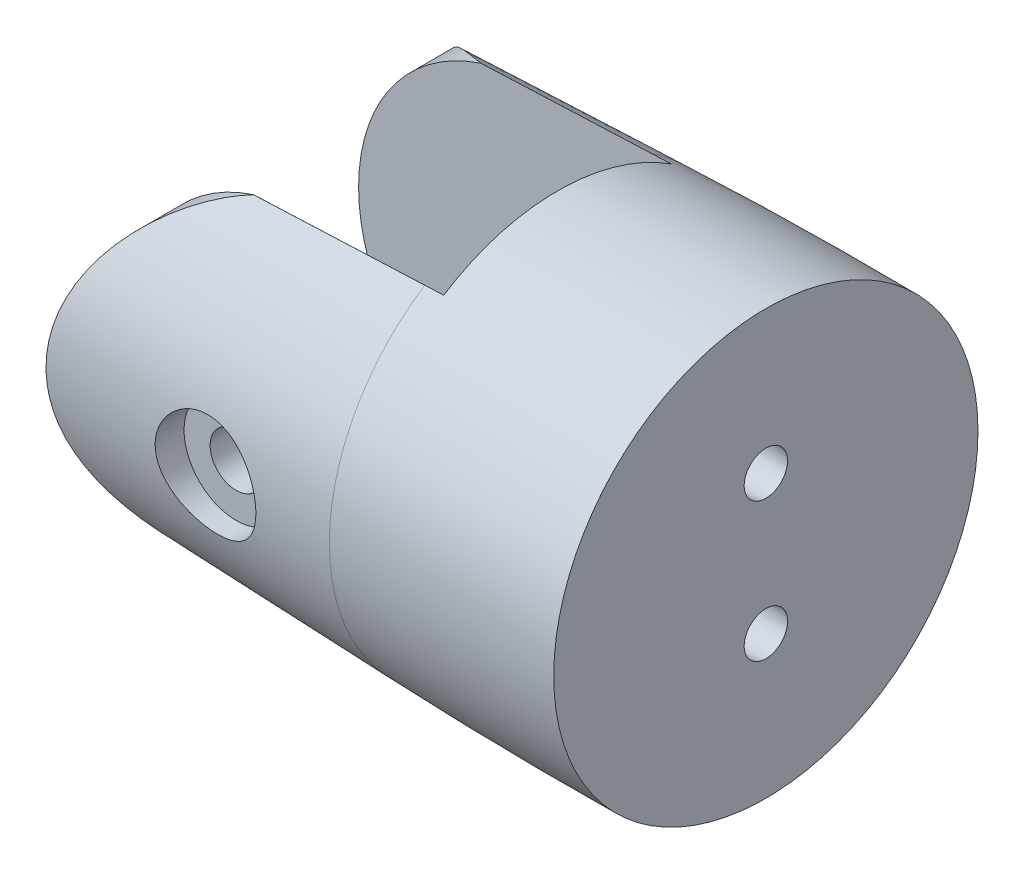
ISO-10303-21;
HEADER;
FILE_DESCRIPTION(('STEP AP214'),'2;1');
FILE_NAME('part.step','',(''),(''),'','','');
FILE_SCHEMA(('AUTOMOTIVE_DESIGN { 1 0 10303 214 1 1 1 1 }'));
ENDSEC;
DATA;
#1=APPLICATION_CONTEXT('core data for automotive mechanical design processes');
#2=APPLICATION_PROTOCOL_DEFINITION('international standard','automotive_design',2000,#1);
#3=PRODUCT_CONTEXT('',#1,'mechanical');
#4=PRODUCT('Part','Part','',(#3));
#5=PRODUCT_RELATED_PRODUCT_CATEGORY('part','',(#4));
#6=PRODUCT_DEFINITION_FORMATION('','',#4);
#7=PRODUCT_DEFINITION_CONTEXT('part definition',#1,'design');
#8=PRODUCT_DEFINITION('design','',#6,#7);
#9=PRODUCT_DEFINITION_SHAPE('','',#8);
#10=(LENGTH_UNIT() NAMED_UNIT(*) SI_UNIT(.MILLI.,.METRE.));
#11=(NAMED_UNIT(*) PLANE_ANGLE_UNIT() SI_UNIT($,.RADIAN.));
#12=(NAMED_UNIT(*) SI_UNIT($,.STERADIAN.) SOLID_ANGLE_UNIT());
#13=UNCERTAINTY_MEASURE_WITH_UNIT(LENGTH_MEASURE(1.E-05),#10,'distance_accuracy_value','');
#14=(GEOMETRIC_REPRESENTATION_CONTEXT(3) GLOBAL_UNCERTAINTY_ASSIGNED_CONTEXT((#13)) GLOBAL_UNIT_ASSIGNED_CONTEXT((#10,
#11,#12)) REPRESENTATION_CONTEXT('',''));
#15=CARTESIAN_POINT('',(0.,0.,0.));
#16=DIRECTION('',(0.,0.,1.));
#17=DIRECTION('',(1.,0.,0.));
#18=AXIS2_PLACEMENT_3D('',#15,#16,#17);
#19=CARTESIAN_POINT('',(0.,0.,0.));
#20=DIRECTION('',(1.,0.,0.));
#21=DIRECTION('',(0.,0.,-1.));
#22=AXIS2_PLACEMENT_3D('',#19,#20,#21);
#23=CONICAL_SURFACE('',#22,12.5,0.0349065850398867);
#24=CARTESIAN_POINT('',(-20.9999999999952,-9.77279188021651,0.));
#25=DIRECTION('',(0.0420082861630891,0.999117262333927,0.));
#26=DIRECTION('',(0.999117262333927,-0.0420082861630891,0.));
#27=AXIS2_PLACEMENT_3D('',#24,#25,#26);
#28=ELLIPSE('',#27,280.103401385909,6.55338971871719);
#29=CARTESIAN_POINT('',(-13.0903037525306,-10.1053582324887,6.55077170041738));
#30=VERTEX_POINT('',#29);
#31=CARTESIAN_POINT('',(-22.9498771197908,-9.69080851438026,6.55323064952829));
#32=VERTEX_POINT('',#31);
#33=EDGE_CURVE('E210',#30,#32,#28,.F.);
#34=ORIENTED_EDGE('',*,*,#33,.F.);
#35=CARTESIAN_POINT('',(-13.0903037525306,0.,0.));
#36=DIRECTION('',(1.,0.,0.));
#37=DIRECTION('',(0.,0.,-1.));
#38=AXIS2_PLACEMENT_3D('',#35,#36,#37);
#39=CIRCLE('',#38,12.0428765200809);
#40=CARTESIAN_POINT('',(-13.0903037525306,10.1053582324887,6.5507717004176));
#41=VERTEX_POINT('',#40);
#42=EDGE_CURVE('E638',#30,#41,#39,.F.);
#43=ORIENTED_EDGE('',*,*,#42,.T.);
#44=CARTESIAN_POINT('',(-21.0000000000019,9.77279188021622,0.));
#45=DIRECTION('',(0.0420082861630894,-0.999117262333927,0.));
#46=DIRECTION('',(0.999117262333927,0.0420082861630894,0.));
#47=AXIS2_PLACEMENT_3D('',#44,#45,#46);
#48=ELLIPSE('',#47,280.103401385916,6.55338971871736);
#49=CARTESIAN_POINT('',(-22.9498771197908,9.69080851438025,6.55323064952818));
#50=VERTEX_POINT('',#49);
#51=EDGE_CURVE('E226',#50,#41,#48,.F.);
#52=ORIENTED_EDGE('',*,*,#51,.F.);
#53=CARTESIAN_POINT('',(-22.9496771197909,-9.69087321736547,6.55314743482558));
#54=CARTESIAN_POINT('',(-23.0999575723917,-9.64224563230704,6.61570730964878));
#55=CARTESIAN_POINT('',(-23.2478404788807,-9.59055452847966,6.68148349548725));
#56=CARTESIAN_POINT('',(-23.5388927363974,-9.48133076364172,6.81818877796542));
#57=CARTESIAN_POINT('',(-23.6820646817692,-9.42380139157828,6.88911496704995));
#58=CARTESIAN_POINT('',(-23.9637096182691,-9.30323209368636,7.03479189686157));
#59=CARTESIAN_POINT('',(-24.1021900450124,-9.24020151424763,7.10953606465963));
#60=CARTESIAN_POINT('',(-24.3748915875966,-9.10870549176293,7.26198183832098));
#61=CARTESIAN_POINT('',(-24.5091120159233,-9.04023917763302,7.33968391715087));
#62=CARTESIAN_POINT('',(-24.9067360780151,-8.82626761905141,7.576586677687));
#63=CARTESIAN_POINT('',(-25.1639513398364,-8.67268558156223,7.73897252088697));
#64=CARTESIAN_POINT('',(-25.6627140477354,-8.34449966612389,8.06673484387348));
#65=CARTESIAN_POINT('',(-25.9042534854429,-8.16988517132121,8.23211279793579));
#66=CARTESIAN_POINT('',(-26.3703049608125,-7.80080677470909,8.56062203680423));
#67=CARTESIAN_POINT('',(-26.5949089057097,-7.60646583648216,8.72376081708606));
#68=CARTESIAN_POINT('',(-27.0280580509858,-7.19700739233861,9.04519751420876));
#69=CARTESIAN_POINT('',(-27.2366050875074,-6.98189226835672,9.2034959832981));
#70=CARTESIAN_POINT('',(-27.6360975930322,-6.53121939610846,9.51167898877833));
#71=CARTESIAN_POINT('',(-27.8270761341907,-6.29570174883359,9.66157911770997));
#72=CARTESIAN_POINT('',(-28.1900952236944,-5.80401574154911,9.95003154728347));
#73=CARTESIAN_POINT('',(-28.3621410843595,-5.54785320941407,10.0885870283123));
#74=CARTESIAN_POINT('',(-28.6444267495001,-5.08239404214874,10.3180459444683));
#75=CARTESIAN_POINT('',(-28.7593317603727,-4.87750264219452,10.4121728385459));
#76=CARTESIAN_POINT('',(-28.9761412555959,-4.45694744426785,10.5907939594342));
#77=CARTESIAN_POINT('',(-29.0780488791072,-4.2412862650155,10.675290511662));
#78=CARTESIAN_POINT('',(-29.2676474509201,-3.79997961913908,10.8332083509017));
#79=CARTESIAN_POINT('',(-29.3553442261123,-3.57433829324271,10.906634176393));
#80=CARTESIAN_POINT('',(-29.5153456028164,-3.11403643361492,11.0410652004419));
#81=CARTESIAN_POINT('',(-29.5876498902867,-2.87937571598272,11.1020701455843));
#82=CARTESIAN_POINT('',(-29.7162027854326,-2.40053071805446,11.2108086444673));
#83=CARTESIAN_POINT('',(-29.772316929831,-2.15628480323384,11.258430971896));
#84=CARTESIAN_POINT('',(-29.8666511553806,-1.66190955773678,11.3386228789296));
#85=CARTESIAN_POINT('',(-29.9048712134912,-1.41178021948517,11.3711924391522));
#86=CARTESIAN_POINT('',(-29.9626180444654,-0.90794314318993,11.4204426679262));
#87=CARTESIAN_POINT('',(-29.9821543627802,-0.654237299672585,11.4371314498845));
#88=CARTESIAN_POINT('',(-30.0021394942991,-0.145540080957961,11.4542038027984));
#89=CARTESIAN_POINT('',(-30.0025904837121,0.109451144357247,11.4545892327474));
#90=CARTESIAN_POINT('',(-29.9855286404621,0.586879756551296,11.4400138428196));
#91=CARTESIAN_POINT('',(-29.9702211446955,0.809459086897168,11.4269370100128));
#92=CARTESIAN_POINT('',(-29.9251968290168,1.25206526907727,11.3885221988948));
#93=CARTESIAN_POINT('',(-29.8954814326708,1.47209237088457,11.3631854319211));
#94=CARTESIAN_POINT('',(-29.8221169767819,1.90809854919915,11.3007487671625));
#95=CARTESIAN_POINT('',(-29.7784680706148,2.12407767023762,11.2636489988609));
#96=CARTESIAN_POINT('',(-29.6778851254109,2.55068328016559,11.1783739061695));
#97=CARTESIAN_POINT('',(-29.620950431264,2.76130950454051,11.1301980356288));
#98=CARTESIAN_POINT('',(-29.4939570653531,3.17809615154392,11.0230873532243));
#99=CARTESIAN_POINT('',(-29.4237771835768,3.38419396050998,10.9640533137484));
#100=CARTESIAN_POINT('',(-29.2714899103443,3.78897416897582,10.8364665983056));
#101=CARTESIAN_POINT('',(-29.1893779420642,3.98765368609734,10.7679102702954));
#102=CARTESIAN_POINT('',(-29.0141072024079,4.37686048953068,10.6222855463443));
#103=CARTESIAN_POINT('',(-28.9209473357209,4.56738696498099,10.5452163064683));
#104=CARTESIAN_POINT('',(-28.7244178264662,4.93981332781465,10.3835765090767));
#105=CARTESIAN_POINT('',(-28.6210460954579,5.1217114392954,10.2990044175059));
#106=CARTESIAN_POINT('',(-28.3547774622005,5.5587779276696,10.0826594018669));
#107=CARTESIAN_POINT('',(-28.1864907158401,5.80884921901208,9.94717125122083));
#108=CARTESIAN_POINT('',(-27.8318385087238,6.28929989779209,9.66535945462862));
#109=CARTESIAN_POINT('',(-27.6454670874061,6.51967274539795,9.51903224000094));
#110=CARTESIAN_POINT('',(-27.255849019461,6.96109265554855,9.2182246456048));
#111=CARTESIAN_POINT('',(-27.0525632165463,7.17209235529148,9.0637256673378));
#112=CARTESIAN_POINT('',(-26.6306079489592,7.57423731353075,8.74995503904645));
#113=CARTESIAN_POINT('',(-26.4119366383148,7.76538018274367,8.59068281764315));
#114=CARTESIAN_POINT('',(-25.9492205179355,8.13636680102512,8.26319972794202));
#115=CARTESIAN_POINT('',(-25.7044674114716,8.31526452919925,8.09491908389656));
#116=CARTESIAN_POINT('',(-25.1987488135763,8.65130250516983,7.76119702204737));
#117=CARTESIAN_POINT('',(-24.9377909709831,8.80845290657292,7.59575431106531));
#118=CARTESIAN_POINT('',(-24.5341882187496,9.02721478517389,7.35434233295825));
#119=CARTESIAN_POINT('',(-24.3979325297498,9.09717565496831,7.27516023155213));
#120=CARTESIAN_POINT('',(-24.1210230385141,9.23148090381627,7.11980775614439));
#121=CARTESIAN_POINT('',(-23.9803699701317,9.29582621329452,7.04363688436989));
#122=CARTESIAN_POINT('',(-23.6942321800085,9.41884065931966,6.89520186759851));
#123=CARTESIAN_POINT('',(-23.5487398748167,9.47750026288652,6.82294437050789));
#124=CARTESIAN_POINT('',(-23.2528861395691,9.58878931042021,6.68373021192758));
#125=CARTESIAN_POINT('',(-23.1025219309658,9.64141523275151,6.61677665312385));
#126=CARTESIAN_POINT('',(-22.9496771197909,9.69087321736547,6.55314743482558));
#127=B_SPLINE_CURVE_WITH_KNOTS('',3,(#53,#54,#55,#56,#57,#58,#59,#60,#61,#62,#63,#64,#65,#66,
#67,#68,#69,#70,#71,#72,#73,#74,#75,#76,#77,#78,#79,#80,#81,#82,#83,#84,#85,#86,#87,#88,#89,#90,
#91,#92,#93,#94,#95,#96,#97,#98,#99,#100,#101,#102,#103,#104,#105,#106,#107,#108,#109,#110,#111,
#112,#113,#114,#115,#116,#117,#118,#119,#120,#121,#122,#123,#124,#125,#126),.UNSPECIFIED.,.F.,
.F.,(4,2,2,2,2,2,2,2,2,2,2,2,2,2,2,2,2,2,2,2,2,2,2,2,2,2,2,2,2,2,2,2,2,2,2,2,4),(0.,
0.509508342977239,1.01873123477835,1.52710521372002,2.03556082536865,3.0566421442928,
4.07824106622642,5.0938231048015,6.1092888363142,7.12280209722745,8.13603024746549,
8.89456564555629,9.65291749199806,10.4109575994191,11.1690131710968,11.9331943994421,
12.6973766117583,13.4611681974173,14.2248726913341,14.8945298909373,15.5641209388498,
16.23370461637,16.9033213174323,17.5793923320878,18.2557233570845,18.9321214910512,
19.6086582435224,20.5986297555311,21.5889286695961,22.5815875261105,23.5743656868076,
24.6135573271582,25.6522621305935,26.169393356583,26.6864387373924,27.204336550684,
27.722535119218),.UNSPECIFIED.);
#128=EDGE_CURVE('E219',#32,#50,#127,.T.);
#129=ORIENTED_EDGE('',*,*,#128,.F.);
#130=EDGE_LOOP('',(#34,#43,#52,#129));
#131=FACE_BOUND('',#130,.T.);
#132=CARTESIAN_POINT('',(-22.5915563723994,-2.75628917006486,11.3821084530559));
#133=CARTESIAN_POINT('',(-22.7130119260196,-2.63816633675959,11.4063472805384));
#134=CARTESIAN_POINT('',(-22.8243953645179,-2.50978719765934,11.4315122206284));
#135=CARTESIAN_POINT('',(-23.0240436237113,-2.23593907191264,11.4811119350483));
#136=CARTESIAN_POINT('',(-23.112293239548,-2.09045893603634,11.5055462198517));
#137=CARTESIAN_POINT('',(-23.2631622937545,-1.78619715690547,11.5513590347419));
#138=CARTESIAN_POINT('',(-23.3257686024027,-1.62740874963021,11.572735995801));
#139=CARTESIAN_POINT('',(-23.4232574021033,-1.30100263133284,11.6105317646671));
#140=CARTESIAN_POINT('',(-23.458148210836,-1.13338758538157,11.6269520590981));
#141=CARTESIAN_POINT('',(-23.4986045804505,-0.796945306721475,11.653390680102));
#142=CARTESIAN_POINT('',(-23.5046393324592,-0.628182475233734,11.6635090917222));
#143=CARTESIAN_POINT('',(-23.4882864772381,-0.291777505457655,11.6773390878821));
#144=CARTESIAN_POINT('',(-23.4659012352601,-0.124135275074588,11.6810512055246));
#145=CARTESIAN_POINT('',(-23.3940567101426,0.201662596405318,11.6824345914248));
#146=CARTESIAN_POINT('',(-23.3451585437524,0.359941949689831,11.6802274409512));
#147=CARTESIAN_POINT('',(-23.2220828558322,0.666194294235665,11.6710735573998));
#148=CARTESIAN_POINT('',(-23.147904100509,0.81416678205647,11.6641265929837));
#149=CARTESIAN_POINT('',(-22.9757273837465,1.09684285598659,11.6470011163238));
#150=CARTESIAN_POINT('',(-22.8775555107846,1.23143898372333,11.6367988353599));
#151=CARTESIAN_POINT('',(-22.6603833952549,1.48251678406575,11.6151311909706));
#152=CARTESIAN_POINT('',(-22.5413808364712,1.59899643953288,11.603665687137));
#153=CARTESIAN_POINT('',(-22.2835790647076,1.81250622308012,11.581367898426));
#154=CARTESIAN_POINT('',(-22.1444825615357,1.90917924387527,11.5705493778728));
#155=CARTESIAN_POINT('',(-21.8518703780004,2.07784364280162,11.5518381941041));
#156=CARTESIAN_POINT('',(-21.6983553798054,2.14983618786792,11.5439453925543));
#157=CARTESIAN_POINT('',(-21.3819097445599,2.26676275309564,11.5328191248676));
#158=CARTESIAN_POINT('',(-21.219021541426,2.31180959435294,11.529566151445));
#159=CARTESIAN_POINT('',(-20.8879922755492,2.37394943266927,11.5287360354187));
#160=CARTESIAN_POINT('',(-20.7198518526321,2.3910458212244,11.5311582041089));
#161=CARTESIAN_POINT('',(-20.3860167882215,2.39678723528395,11.5418723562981));
#162=CARTESIAN_POINT('',(-20.220326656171,2.38588872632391,11.5500686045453));
#163=CARTESIAN_POINT('',(-19.8933384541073,2.33705091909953,11.5716977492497));
#164=CARTESIAN_POINT('',(-19.7320405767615,2.29911043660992,11.5851308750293));
#165=CARTESIAN_POINT('',(-19.4174998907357,2.19717746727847,11.6160725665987));
#166=CARTESIAN_POINT('',(-19.26429762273,2.13306574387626,11.6335996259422));
#167=CARTESIAN_POINT('',(-18.9707393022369,1.98064015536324,11.6709134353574));
#168=CARTESIAN_POINT('',(-18.8303851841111,1.89232265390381,11.6907005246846));
#169=CARTESIAN_POINT('',(-18.5632213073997,1.69164344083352,11.7308635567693));
#170=CARTESIAN_POINT('',(-18.4367751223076,1.57879789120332,11.7512429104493));
#171=CARTESIAN_POINT('',(-18.2044875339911,1.33324510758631,11.7897888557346));
#172=CARTESIAN_POINT('',(-18.0986467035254,1.20053732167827,11.8079553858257));
#173=CARTESIAN_POINT('',(-17.9104756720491,0.918565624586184,11.8398206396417));
#174=CARTESIAN_POINT('',(-17.8281831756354,0.769275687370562,11.8535122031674));
#175=CARTESIAN_POINT('',(-17.6899360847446,0.458544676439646,11.8744217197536));
#176=CARTESIAN_POINT('',(-17.633975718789,0.297106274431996,11.8816410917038));
#177=CARTESIAN_POINT('',(-17.551398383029,-0.0284247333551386,11.8881405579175));
#178=CARTESIAN_POINT('',(-17.524000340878,-0.192314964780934,11.8876382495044));
#179=CARTESIAN_POINT('',(-17.4966006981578,-0.522140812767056,11.8786789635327));
#180=CARTESIAN_POINT('',(-17.496595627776,-0.688076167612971,11.8702229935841));
#181=CARTESIAN_POINT('',(-17.5235146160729,-1.01400120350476,11.8458482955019));
#182=CARTESIAN_POINT('',(-17.549932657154,-1.17404401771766,11.8300727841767));
#183=CARTESIAN_POINT('',(-17.6278837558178,-1.48707850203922,11.7920706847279));
#184=CARTESIAN_POINT('',(-17.6794194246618,-1.64006943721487,11.7698434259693));
#185=CARTESIAN_POINT('',(-17.8072610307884,-1.93829717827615,11.7199387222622));
#186=CARTESIAN_POINT('',(-17.8840697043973,-2.08330035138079,11.6921555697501));
#187=CARTESIAN_POINT('',(-18.0598851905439,-2.35847608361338,11.6335083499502));
#188=CARTESIAN_POINT('',(-18.1588975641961,-2.4886449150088,11.602643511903));
#189=CARTESIAN_POINT('',(-18.3810297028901,-2.7360402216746,11.538893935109));
#190=CARTESIAN_POINT('',(-18.5049635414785,-2.85252883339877,11.5059780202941));
#191=CARTESIAN_POINT('',(-18.7710336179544,-3.06314963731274,11.4420908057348));
#192=CARTESIAN_POINT('',(-18.9131719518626,-3.15727925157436,11.4111197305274));
#193=CARTESIAN_POINT('',(-19.2134135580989,-3.32116326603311,11.3535887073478));
#194=CARTESIAN_POINT('',(-19.3716466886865,-3.39069515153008,11.3270701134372));
#195=CARTESIAN_POINT('',(-19.6986368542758,-3.5017524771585,11.2812787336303));
#196=CARTESIAN_POINT('',(-19.867390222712,-3.54328761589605,11.2620034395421));
#197=CARTESIAN_POINT('',(-20.2034215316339,-3.59556403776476,11.2330997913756));
#198=CARTESIAN_POINT('',(-20.3704868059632,-3.60747444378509,11.2231152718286));
#199=CARTESIAN_POINT('',(-20.7045656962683,-3.60328959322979,11.212206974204));
#200=CARTESIAN_POINT('',(-20.8715793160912,-3.58719783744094,11.2112820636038));
#201=CARTESIAN_POINT('',(-21.1944934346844,-3.52856974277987,11.2180463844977));
#202=CARTESIAN_POINT('',(-21.3505777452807,-3.48700030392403,11.2254285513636));
#203=CARTESIAN_POINT('',(-21.6535829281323,-3.37961466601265,11.2471747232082));
#204=CARTESIAN_POINT('',(-21.8005073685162,-3.31380797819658,11.261535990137));
#205=CARTESIAN_POINT('',(-22.0598896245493,-3.17177133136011,11.2928736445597));
#206=CARTESIAN_POINT('',(-22.1741779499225,-3.09868684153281,11.3091113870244));
#207=CARTESIAN_POINT('',(-22.391628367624,-2.93800258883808,11.3440727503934));
#208=CARTESIAN_POINT('',(-22.4947891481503,-2.85040111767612,11.3627966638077));
#209=CARTESIAN_POINT('',(-22.5915563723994,-2.75628917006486,11.3821084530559));
#210=B_SPLINE_CURVE_WITH_KNOTS('',3,(#132,#133,#134,#135,#136,#137,#138,#139,#140,#141,#142,
#143,#144,#145,#146,#147,#148,#149,#150,#151,#152,#153,#154,#155,#156,#157,#158,#159,#160,#161,
#162,#163,#164,#165,#166,#167,#168,#169,#170,#171,#172,#173,#174,#175,#176,#177,#178,#179,#180,
#181,#182,#183,#184,#185,#186,#187,#188,#189,#190,#191,#192,#193,#194,#195,#196,#197,#198,#199,
#200,#201,#202,#203,#204,#205,#206,#207,#208,#209),.UNSPECIFIED.,.T.,.F.,(4,2,2,2,2,2,2,2,2,2,2,
2,2,2,2,2,2,2,2,2,2,2,2,2,2,2,2,2,2,2,2,2,2,2,2,2,2,2,4),(0.,0.512961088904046,1.02625848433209,
1.53981836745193,2.05322406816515,2.55825288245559,3.06323966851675,3.55793391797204,
4.05265231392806,4.5510688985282,5.04954093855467,5.55633351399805,6.06310212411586,
6.56773377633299,7.0723041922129,7.56869983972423,8.06511722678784,8.5638219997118,
9.06260173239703,9.57229553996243,10.0820035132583,10.5925231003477,11.1029307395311,
11.5989820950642,12.0949706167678,12.5816391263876,13.068358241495,13.5654123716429,
14.0625911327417,14.5799096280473,15.0972877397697,15.6192331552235,16.1409976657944,
16.6418189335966,17.1425775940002,17.6254170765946,18.1080672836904,18.5167104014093,
18.925401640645),.UNSPECIFIED.);
#211=CARTESIAN_POINT('',(-22.5915563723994,-2.75628917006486,11.3821084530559));
#212=VERTEX_POINT('',#211);
#213=EDGE_CURVE('E339',#212,#212,#210,.T.);
#214=ORIENTED_EDGE('',*,*,#213,.T.);
#215=EDGE_LOOP('',(#214));
#216=FACE_BOUND('',#215,.T.);
#217=ADVANCED_FACE('F33',(#131,#216),#23,.T.);
#218=CARTESIAN_POINT('',(-20.5,-0.605616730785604,-12.5));
#219=DIRECTION('',(0.,0.,1.));
#220=DIRECTION('',(1.,0.,0.));
#221=AXIS2_PLACEMENT_3D('',#218,#219,#220);
#222=CYLINDRICAL_SURFACE('',#221,1.5);
#223=CARTESIAN_POINT('',(-20.5,-0.605616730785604,6.55));
#224=DIRECTION('',(0.,0.,1.));
#225=DIRECTION('',(1.,0.,0.));
#226=AXIS2_PLACEMENT_3D('',#223,#224,#225);
#227=CIRCLE('',#226,1.5);
#228=CARTESIAN_POINT('',(-19.,-0.605616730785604,6.55));
#229=VERTEX_POINT('',#228);
#230=EDGE_CURVE('E202',#229,#229,#227,.T.);
#231=ORIENTED_EDGE('',*,*,#230,.F.);
#232=EDGE_LOOP('',(#231));
#233=FACE_BOUND('',#232,.T.);
#234=CARTESIAN_POINT('',(-20.5,-0.605616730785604,10.));
#235=DIRECTION('',(0.,0.,1.));
#236=DIRECTION('',(1.,0.,0.));
#237=AXIS2_PLACEMENT_3D('',#234,#235,#236);
#238=CIRCLE('',#237,1.5);
#239=CARTESIAN_POINT('',(-19.,-0.605616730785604,10.));
#240=VERTEX_POINT('',#239);
#241=EDGE_CURVE('E197',#240,#240,#238,.F.);
#242=ORIENTED_EDGE('',*,*,#241,.F.);
#243=EDGE_LOOP('',(#242));
#244=FACE_BOUND('',#243,.T.);
#245=ADVANCED_FACE('F324',(#233,#244),#222,.F.);
#246=CARTESIAN_POINT('',(-23.4784891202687,0.235488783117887,0.));
#247=DIRECTION('',(-0.866025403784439,0.5,0.));
#248=DIRECTION('',(0.5,0.866025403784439,0.));
#249=AXIS2_PLACEMENT_3D('',#246,#247,#248);
#250=ELLIPSE('',#249,13.4870328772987,11.6777389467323);
#251=CARTESIAN_POINT('',(-23.9641016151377,-0.605616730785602,-11.6474210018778));
#252=VERTEX_POINT('',#251);
#253=CARTESIAN_POINT('',(-22.2320508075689,2.3943832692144,-11.4765263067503));
#254=VERTEX_POINT('',#253);
#255=EDGE_CURVE('E11',#252,#254,#250,.F.);
#256=ORIENTED_EDGE('',*,*,#255,.F.);
#257=CARTESIAN_POINT('',(-24.1780794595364,-0.234996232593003,0.));
#258=DIRECTION('',(-0.866025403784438,-0.5,0.));
#259=DIRECTION('',(0.5,-0.866025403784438,0.));
#260=AXIS2_PLACEMENT_3D('',#257,#258,#259);
#261=ELLIPSE('',#260,13.4588232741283,11.6533136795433);
#262=CARTESIAN_POINT('',(-22.2320508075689,-3.6056167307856,-11.1554137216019));
#263=VERTEX_POINT('',#262);
#264=EDGE_CURVE('E149',#263,#252,#261,.F.);
#265=ORIENTED_EDGE('',*,*,#264,.F.);
#266=CARTESIAN_POINT('',(-13.7933177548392,-3.6056167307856,-11.4647156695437));
#267=CARTESIAN_POINT('',(-16.4558054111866,-3.6056167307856,-11.3672560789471));
#268=CARTESIAN_POINT('',(-19.1182886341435,-3.6056167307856,-11.269675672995));
#269=CARTESIAN_POINT('',(-24.4432462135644,-3.6056167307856,-11.0742732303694));
#270=CARTESIAN_POINT('',(-27.1057205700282,-3.6056167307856,-10.9764511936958));
#271=CARTESIAN_POINT('',(-29.7681904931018,-3.6056167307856,-10.8785083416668));
#272=B_SPLINE_CURVE_WITH_KNOTS('',3,(#266,#267,#268,#269,#270,#271),.UNSPECIFIED.,.F.,.F.,(4,2,
4),(0.,7.99281237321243,15.9856247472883),.UNSPECIFIED.);
#273=CARTESIAN_POINT('',(-18.7679491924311,-3.6056167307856,-11.2824768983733));
#274=VERTEX_POINT('',#273);
#275=EDGE_CURVE('E407',#274,#263,#272,.T.);
#276=ORIENTED_EDGE('',*,*,#275,.F.);
#277=CARTESIAN_POINT('',(-16.5474685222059,0.240368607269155,0.));
#278=DIRECTION('',(0.866025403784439,-0.5,0.));
#279=DIRECTION('',(0.5,0.866025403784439,0.));
#280=AXIS2_PLACEMENT_3D('',#277,#278,#279);
#281=ELLIPSE('',#280,13.7665126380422,11.9197263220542);
#282=CARTESIAN_POINT('',(-17.0358983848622,-0.605616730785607,-11.8896793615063));
#283=VERTEX_POINT('',#282);
#284=EDGE_CURVE('E405',#283,#274,#281,.F.);
#285=ORIENTED_EDGE('',*,*,#284,.F.);
#286=CARTESIAN_POINT('',(-17.2470588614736,-0.23987605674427,0.));
#287=DIRECTION('',(0.866025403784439,0.5,0.));
#288=DIRECTION('',(0.5,-0.866025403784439,0.));
#289=AXIS2_PLACEMENT_3D('',#286,#287,#288);
#290=ELLIPSE('',#289,13.7383030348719,11.8953010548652);
#291=CARTESIAN_POINT('',(-18.7679491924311,2.3943832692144,-11.6000726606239));
#292=VERTEX_POINT('',#291);
#293=EDGE_CURVE('E403',#292,#283,#290,.F.);
#294=ORIENTED_EDGE('',*,*,#293,.F.);
#295=CARTESIAN_POINT('',(-29.7803596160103,2.3943832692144,-11.2071229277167));
#296=CARTESIAN_POINT('',(-27.1177857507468,2.3943832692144,-11.3021979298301));
#297=CARTESIAN_POINT('',(-24.4552101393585,2.3943832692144,-11.3972239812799));
#298=CARTESIAN_POINT('',(-19.1300554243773,2.3943832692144,-11.5871781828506));
#299=CARTESIAN_POINT('',(-16.4674763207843,2.3943832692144,-11.6821063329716));
#300=CARTESIAN_POINT('',(-13.8048954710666,2.39438326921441,-11.776985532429));
#301=B_SPLINE_CURVE_WITH_KNOTS('',3,(#295,#296,#297,#298,#299,#300),.UNSPECIFIED.,.F.,.F.,(4,2,
4),(0.,7.99281236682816,15.9856247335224),.UNSPECIFIED.);
#302=EDGE_CURVE('E41',#254,#292,#301,.T.);
#303=ORIENTED_EDGE('',*,*,#302,.F.);
#304=EDGE_LOOP('',(#256,#265,#276,#285,#294,#303));
#305=FACE_BOUND('',#304,.T.);
#306=CARTESIAN_POINT('',(-13.0903037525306,10.1053582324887,-6.5507717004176));
#307=VERTEX_POINT('',#306);
#308=CARTESIAN_POINT('',(-22.9498771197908,9.69080851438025,-6.55323064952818));
#309=VERTEX_POINT('',#308);
#310=EDGE_CURVE('E651',#307,#309,#48,.F.);
#311=ORIENTED_EDGE('',*,*,#310,.F.);
#312=CARTESIAN_POINT('',(-13.0903037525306,0.,0.));
#313=DIRECTION('',(1.,0.,0.));
#314=DIRECTION('',(0.,0.,-1.));
#315=AXIS2_PLACEMENT_3D('',#312,#313,#314);
#316=CIRCLE('',#315,12.0428765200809);
#317=CARTESIAN_POINT('',(-13.0903037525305,-10.1053582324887,-6.55077170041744));
#318=VERTEX_POINT('',#317);
#319=EDGE_CURVE('E634',#307,#318,#316,.F.);
#320=ORIENTED_EDGE('',*,*,#319,.T.);
#321=CARTESIAN_POINT('',(-22.9498771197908,-9.69080851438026,-6.55323064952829));
#322=VERTEX_POINT('',#321);
#323=EDGE_CURVE('E213',#322,#318,#28,.F.);
#324=ORIENTED_EDGE('',*,*,#323,.F.);
#325=CARTESIAN_POINT('',(-22.9496771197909,9.69087321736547,-6.55314743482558));
#326=CARTESIAN_POINT('',(-23.0999575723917,9.64224563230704,-6.61570730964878));
#327=CARTESIAN_POINT('',(-23.2478404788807,9.59055452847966,-6.68148349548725));
#328=CARTESIAN_POINT('',(-23.5388927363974,9.48133076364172,-6.81818877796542));
#329=CARTESIAN_POINT('',(-23.6820646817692,9.42380139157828,-6.88911496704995));
#330=CARTESIAN_POINT('',(-23.9637096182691,9.30323209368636,-7.03479189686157));
#331=CARTESIAN_POINT('',(-24.1021900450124,9.24020151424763,-7.10953606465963));
#332=CARTESIAN_POINT('',(-24.3748915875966,9.10870549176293,-7.26198183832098));
#333=CARTESIAN_POINT('',(-24.5091120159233,9.04023917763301,-7.33968391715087));
#334=CARTESIAN_POINT('',(-24.9067360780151,8.82626761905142,-7.576586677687));
#335=CARTESIAN_POINT('',(-25.1639513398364,8.67268558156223,-7.73897252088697));
#336=CARTESIAN_POINT('',(-25.6627140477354,8.34449966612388,-8.06673484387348));
#337=CARTESIAN_POINT('',(-25.9042534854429,8.16988517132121,-8.23211279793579));
#338=CARTESIAN_POINT('',(-26.3703049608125,7.80080677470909,-8.56062203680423));
#339=CARTESIAN_POINT('',(-26.5949089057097,7.60646583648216,-8.72376081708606));
#340=CARTESIAN_POINT('',(-27.0280580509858,7.19700739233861,-9.04519751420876));
#341=CARTESIAN_POINT('',(-27.2366050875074,6.98189226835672,-9.2034959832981));
#342=CARTESIAN_POINT('',(-27.6360975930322,6.53121939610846,-9.51167898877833));
#343=CARTESIAN_POINT('',(-27.8270761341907,6.29570174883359,-9.66157911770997));
#344=CARTESIAN_POINT('',(-28.1900952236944,5.80401574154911,-9.95003154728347));
#345=CARTESIAN_POINT('',(-28.3621410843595,5.54785320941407,-10.0885870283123));
#346=CARTESIAN_POINT('',(-28.6444267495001,5.08239404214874,-10.3180459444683));
#347=CARTESIAN_POINT('',(-28.7593317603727,4.87750264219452,-10.4121728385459));
#348=CARTESIAN_POINT('',(-28.9761412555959,4.45694744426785,-10.5907939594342));
#349=CARTESIAN_POINT('',(-29.0780488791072,4.2412862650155,-10.675290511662));
#350=CARTESIAN_POINT('',(-29.2676474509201,3.79997961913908,-10.8332083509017));
#351=CARTESIAN_POINT('',(-29.3553442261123,3.57433829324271,-10.906634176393));
#352=CARTESIAN_POINT('',(-29.5153456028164,3.11403643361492,-11.0410652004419));
#353=CARTESIAN_POINT('',(-29.5876498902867,2.87937571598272,-11.1020701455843));
#354=CARTESIAN_POINT('',(-29.7162027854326,2.40053071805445,-11.2108086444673));
#355=CARTESIAN_POINT('',(-29.772316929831,2.15628480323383,-11.258430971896));
#356=CARTESIAN_POINT('',(-29.8666511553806,1.66190955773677,-11.3386228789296));
#357=CARTESIAN_POINT('',(-29.9048712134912,1.41178021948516,-11.3711924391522));
#358=CARTESIAN_POINT('',(-29.9626180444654,0.907943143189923,-11.4204426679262));
#359=CARTESIAN_POINT('',(-29.9821543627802,0.654237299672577,-11.4371314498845));
#360=CARTESIAN_POINT('',(-30.0021394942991,0.145540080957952,-11.4542038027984));
#361=CARTESIAN_POINT('',(-30.0025904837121,-0.109451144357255,-11.4545892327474));
#362=CARTESIAN_POINT('',(-29.9855286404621,-0.586879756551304,-11.4400138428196));
#363=CARTESIAN_POINT('',(-29.9702211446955,-0.809459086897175,-11.4269370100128));
#364=CARTESIAN_POINT('',(-29.9251968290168,-1.25206526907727,-11.3885221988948));
#365=CARTESIAN_POINT('',(-29.8954814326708,-1.47209237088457,-11.3631854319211));
#366=CARTESIAN_POINT('',(-29.8221169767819,-1.90809854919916,-11.3007487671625));
#367=CARTESIAN_POINT('',(-29.7784680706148,-2.12407767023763,-11.2636489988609));
#368=CARTESIAN_POINT('',(-29.6778851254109,-2.55068328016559,-11.1783739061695));
#369=CARTESIAN_POINT('',(-29.620950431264,-2.76130950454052,-11.1301980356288));
#370=CARTESIAN_POINT('',(-29.4939570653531,-3.17809615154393,-11.0230873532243));
#371=CARTESIAN_POINT('',(-29.4237771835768,-3.38419396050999,-10.9640533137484));
#372=CARTESIAN_POINT('',(-29.2714899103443,-3.78897416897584,-10.8364665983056));
#373=CARTESIAN_POINT('',(-29.1893779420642,-3.98765368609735,-10.7679102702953));
#374=CARTESIAN_POINT('',(-29.0141072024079,-4.37686048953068,-10.6222855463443));
#375=CARTESIAN_POINT('',(-28.9209473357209,-4.567386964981,-10.5452163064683));
#376=CARTESIAN_POINT('',(-28.7244178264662,-4.93981332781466,-10.3835765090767));
#377=CARTESIAN_POINT('',(-28.6210460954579,-5.1217114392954,-10.2990044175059));
#378=CARTESIAN_POINT('',(-28.3547774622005,-5.5587779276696,-10.0826594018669));
#379=CARTESIAN_POINT('',(-28.1864907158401,-5.80884921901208,-9.94717125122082));
#380=CARTESIAN_POINT('',(-27.8318385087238,-6.28929989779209,-9.66535945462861));
#381=CARTESIAN_POINT('',(-27.6454670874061,-6.51967274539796,-9.51903224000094));
#382=CARTESIAN_POINT('',(-27.255849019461,-6.96109265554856,-9.2182246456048));
#383=CARTESIAN_POINT('',(-27.0525632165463,-7.17209235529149,-9.06372566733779));
#384=CARTESIAN_POINT('',(-26.6306079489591,-7.57423731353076,-8.74995503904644));
#385=CARTESIAN_POINT('',(-26.4119366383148,-7.76538018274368,-8.59068281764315));
#386=CARTESIAN_POINT('',(-25.9492205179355,-8.13636680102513,-8.26319972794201));
#387=CARTESIAN_POINT('',(-25.7044674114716,-8.31526452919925,-8.09491908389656));
#388=CARTESIAN_POINT('',(-25.1987488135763,-8.65130250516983,-7.76119702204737));
#389=CARTESIAN_POINT('',(-24.9377909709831,-8.80845290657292,-7.59575431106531));
#390=CARTESIAN_POINT('',(-24.5341882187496,-9.02721478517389,-7.35434233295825));
#391=CARTESIAN_POINT('',(-24.3979325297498,-9.09717565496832,-7.27516023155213));
#392=CARTESIAN_POINT('',(-24.1210230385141,-9.23148090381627,-7.11980775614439));
#393=CARTESIAN_POINT('',(-23.9803699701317,-9.29582621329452,-7.04363688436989));
#394=CARTESIAN_POINT('',(-23.6942321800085,-9.41884065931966,-6.89520186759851));
#395=CARTESIAN_POINT('',(-23.5487398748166,-9.47750026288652,-6.82294437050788));
#396=CARTESIAN_POINT('',(-23.2528861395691,-9.58878931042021,-6.68373021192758));
#397=CARTESIAN_POINT('',(-23.1025219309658,-9.64141523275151,-6.61677665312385));
#398=CARTESIAN_POINT('',(-22.9496771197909,-9.69087321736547,-6.55314743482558));
#399=B_SPLINE_CURVE_WITH_KNOTS('',3,(#325,#326,#327,#328,#329,#330,#331,#332,#333,#334,#335,
#336,#337,#338,#339,#340,#341,#342,#343,#344,#345,#346,#347,#348,#349,#350,#351,#352,#353,#354,
#355,#356,#357,#358,#359,#360,#361,#362,#363,#364,#365,#366,#367,#368,#369,#370,#371,#372,#373,
#374,#375,#376,#377,#378,#379,#380,#381,#382,#383,#384,#385,#386,#387,#388,#389,#390,#391,#392,
#393,#394,#395,#396,#397,#398),.UNSPECIFIED.,.F.,.F.,(4,2,2,2,2,2,2,2,2,2,2,2,2,2,2,2,2,2,2,2,2,
2,2,2,2,2,2,2,2,2,2,2,2,2,2,2,4),(0.,0.509508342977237,1.01873123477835,1.52710521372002,
2.03556082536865,3.05664214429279,4.07824106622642,5.0938231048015,6.1092888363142,
7.12280209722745,8.13603024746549,8.89456564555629,9.65291749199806,10.4109575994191,
11.1690131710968,11.9331943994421,12.6973766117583,13.4611681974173,14.2248726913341,
14.8945298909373,15.5641209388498,16.2337046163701,16.9033213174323,17.5793923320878,
18.2557233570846,18.9321214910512,19.6086582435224,20.5986297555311,21.5889286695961,
22.5815875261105,23.5743656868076,24.6135573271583,25.6522621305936,26.169393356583,
26.6864387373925,27.2043365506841,27.722535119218),.UNSPECIFIED.);
#400=EDGE_CURVE('E218',#309,#322,#399,.T.);
#401=ORIENTED_EDGE('',*,*,#400,.F.);
#402=EDGE_LOOP('',(#311,#320,#324,#401));
#403=FACE_BOUND('',#402,.T.);
#404=ADVANCED_FACE('F318',(#305,#403),#23,.T.);
#405=CARTESIAN_POINT('',(-30.,-12.5,-6.55));
#406=DIRECTION('',(0.,0.,-1.));
#407=DIRECTION('',(-1.,0.,0.));
#408=AXIS2_PLACEMENT_3D('',#405,#406,#407);
#409=PLANE('',#408);
#410=CARTESIAN_POINT('',(-20.5,-0.605616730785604,-6.55));
#411=DIRECTION('',(0.,0.,-1.));
#412=DIRECTION('',(-1.,0.,0.));
#413=AXIS2_PLACEMENT_3D('',#410,#411,#412);
#414=CIRCLE('',#413,1.5);
#415=CARTESIAN_POINT('',(-22.,-0.605616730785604,-6.55));
#416=VERTEX_POINT('',#415);
#417=EDGE_CURVE('E198',#416,#416,#414,.T.);
#418=ORIENTED_EDGE('',*,*,#417,.T.);
#419=EDGE_LOOP('',(#418));
#420=FACE_BOUND('',#419,.T.);
#421=DIRECTION('',(0.999117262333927,-0.0420082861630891,0.));
#422=VECTOR('',#421,1.);
#423=CARTESIAN_POINT('',(-29.8696535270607,-9.39986373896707,-6.55));
#424=LINE('',#423,#422);
#425=CARTESIAN_POINT('',(-22.9498771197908,-9.69080851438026,-6.55));
#426=VERTEX_POINT('',#425);
#427=CARTESIAN_POINT('',(-12.6876363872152,-10.1222885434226,-6.55));
#428=VERTEX_POINT('',#427);
#429=EDGE_CURVE('E212',#426,#428,#424,.T.);
#430=ORIENTED_EDGE('',*,*,#429,.T.);
#431=CARTESIAN_POINT('',(-12.6876363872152,-10.1222885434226,-6.55));
#432=CARTESIAN_POINT('',(-12.5730364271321,-10.1268716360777,-6.55));
#433=CARTESIAN_POINT('',(-12.4584334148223,-10.1313756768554,-6.55));
#434=CARTESIAN_POINT('',(-12.2292212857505,-10.1402256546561,-6.55));
#435=CARTESIAN_POINT('',(-12.1146121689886,-10.1445715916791,-6.55));
#436=CARTESIAN_POINT('',(-12.,-10.1488384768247,-6.55));
#437=B_SPLINE_CURVE_WITH_KNOTS('',3,(#431,#432,#433,#434,#435,#436),.UNSPECIFIED.,.F.,.F.,(4,2,
4),(0.,0.344074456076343,0.688148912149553),.UNSPECIFIED.);
#438=CARTESIAN_POINT('',(-12.,-10.1488384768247,-6.55));
#439=VERTEX_POINT('',#438);
#440=EDGE_CURVE('E293',#428,#439,#437,.T.);
#441=ORIENTED_EDGE('',*,*,#440,.T.);
#442=DIRECTION('',(0.,1.,0.));
#443=VECTOR('',#442,1.);
#444=CARTESIAN_POINT('',(-12.,-12.5,-6.55));
#445=LINE('',#444,#443);
#446=CARTESIAN_POINT('',(-12.,10.1488384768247,-6.55));
#447=VERTEX_POINT('',#446);
#448=EDGE_CURVE('E621',#439,#447,#445,.T.);
#449=ORIENTED_EDGE('',*,*,#448,.T.);
#450=CARTESIAN_POINT('',(-12.,10.1488384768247,-6.55));
#451=CARTESIAN_POINT('',(-12.114612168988,10.1445715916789,-6.55));
#452=CARTESIAN_POINT('',(-12.2292212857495,10.140225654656,-6.55));
#453=CARTESIAN_POINT('',(-12.4584334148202,10.1313756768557,-6.55));
#454=CARTESIAN_POINT('',(-12.5730364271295,10.1268716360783,-6.55));
#455=CARTESIAN_POINT('',(-12.6876363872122,10.1222885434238,-6.55));
#456=B_SPLINE_CURVE_WITH_KNOTS('',3,(#450,#451,#452,#453,#454,#455),.UNSPECIFIED.,.F.,.F.,(4,2,
4),(0.,0.344074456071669,0.688148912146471),.UNSPECIFIED.);
#457=CARTESIAN_POINT('',(-12.6876363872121,10.1222885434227,-6.55));
#458=VERTEX_POINT('',#457);
#459=EDGE_CURVE('E287',#447,#458,#456,.T.);
#460=ORIENTED_EDGE('',*,*,#459,.T.);
#461=DIRECTION('',(-0.999117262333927,-0.0420082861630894,0.));
#462=VECTOR('',#461,1.);
#463=CARTESIAN_POINT('',(-30.9189336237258,9.35574633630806,-6.55));
#464=LINE('',#463,#462);
#465=CARTESIAN_POINT('',(-22.9498771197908,9.69080851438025,-6.55));
#466=VERTEX_POINT('',#465);
#467=EDGE_CURVE('E653',#458,#466,#464,.T.);
#468=ORIENTED_EDGE('',*,*,#467,.T.);
#469=CARTESIAN_POINT('',(-19.814645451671,0.,-6.55));
#470=DIRECTION('',(0.,0.,-1.));
#471=DIRECTION('',(-1.,0.,0.));
#472=AXIS2_PLACEMENT_3D('',#469,#470,#471);
#473=CIRCLE('',#472,10.185354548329);
#474=EDGE_CURVE('E216',#466,#426,#473,.F.);
#475=ORIENTED_EDGE('',*,*,#474,.T.);
#476=EDGE_LOOP('',(#430,#441,#449,#460,#468,#475));
#477=FACE_BOUND('',#476,.T.);
#478=ADVANCED_FACE('F314',(#420,#477),#409,.F.);
#479=CARTESIAN_POINT('',(-12.,-12.5,-6.55));
#480=DIRECTION('',(1.,0.,0.));
#481=DIRECTION('',(0.,0.,-1.));
#482=AXIS2_PLACEMENT_3D('',#479,#480,#481);
#483=PLANE('',#482);
#484=CARTESIAN_POINT('',(-12.,-4.,0.));
#485=DIRECTION('',(1.,0.,0.));
#486=DIRECTION('',(0.,0.,-1.));
#487=AXIS2_PLACEMENT_3D('',#484,#485,#486);
#488=CIRCLE('',#487,3.95415191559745);
#489=CARTESIAN_POINT('',(-12.,-4.,-3.95415191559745));
#490=VERTEX_POINT('',#489);
#491=EDGE_CURVE('E604',#490,#490,#488,.T.);
#492=ORIENTED_EDGE('',*,*,#491,.T.);
#493=EDGE_LOOP('',(#492));
#494=FACE_BOUND('',#493,.T.);
#495=CARTESIAN_POINT('',(-12.,4.,0.));
#496=DIRECTION('',(1.,0.,0.));
#497=DIRECTION('',(0.,0.,-1.));
#498=AXIS2_PLACEMENT_3D('',#495,#496,#497);
#499=CIRCLE('',#498,3.95415191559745);
#500=CARTESIAN_POINT('',(-12.,4.,-3.95415191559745));
#501=VERTEX_POINT('',#500);
#502=EDGE_CURVE('E602',#501,#501,#499,.T.);
#503=ORIENTED_EDGE('',*,*,#502,.T.);
#504=EDGE_LOOP('',(#503));
#505=FACE_BOUND('',#504,.T.);
#506=ORIENTED_EDGE('',*,*,#448,.F.);
#507=CARTESIAN_POINT('',(-12.,0.,0.));
#508=DIRECTION('',(-1.,0.,0.));
#509=DIRECTION('',(0.,0.,1.));
#510=AXIS2_PLACEMENT_3D('',#507,#508,#509);
#511=CIRCLE('',#510,12.0789661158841);
#512=CARTESIAN_POINT('',(-12.,-10.1488384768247,6.55));
#513=VERTEX_POINT('',#512);
#514=EDGE_CURVE('E305',#439,#513,#511,.T.);
#515=ORIENTED_EDGE('',*,*,#514,.T.);
#516=DIRECTION('',(0.,1.,0.));
#517=VECTOR('',#516,1.);
#518=CARTESIAN_POINT('',(-12.,-12.5,6.55));
#519=LINE('',#518,#517);
#520=CARTESIAN_POINT('',(-12.,10.1488384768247,6.55));
#521=VERTEX_POINT('',#520);
#522=EDGE_CURVE('E628',#513,#521,#519,.T.);
#523=ORIENTED_EDGE('',*,*,#522,.T.);
#524=CARTESIAN_POINT('',(-12.,0.,0.));
#525=DIRECTION('',(-1.,0.,0.));
#526=DIRECTION('',(0.,0.,1.));
#527=AXIS2_PLACEMENT_3D('',#524,#525,#526);
#528=CIRCLE('',#527,12.0789661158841);
#529=EDGE_CURVE('E625',#521,#447,#528,.T.);
#530=ORIENTED_EDGE('',*,*,#529,.T.);
#531=EDGE_LOOP('',(#506,#515,#523,#530));
#532=FACE_BOUND('',#531,.T.);
#533=ADVANCED_FACE('F310',(#494,#505,#532),#483,.F.);
#534=CARTESIAN_POINT('',(-30.,-12.5,6.55));
#535=DIRECTION('',(0.,0.,1.));
#536=DIRECTION('',(1.,0.,0.));
#537=AXIS2_PLACEMENT_3D('',#534,#535,#536);
#538=PLANE('',#537);
#539=ORIENTED_EDGE('',*,*,#230,.T.);
#540=EDGE_LOOP('',(#539));
#541=FACE_BOUND('',#540,.T.);
#542=ORIENTED_EDGE('',*,*,#522,.F.);
#543=CARTESIAN_POINT('',(-12.,-10.1488384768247,6.55));
#544=CARTESIAN_POINT('',(-12.1146121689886,-10.1445715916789,6.55));
#545=CARTESIAN_POINT('',(-12.2292212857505,-10.140225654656,6.55));
#546=CARTESIAN_POINT('',(-12.4584334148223,-10.1313756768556,6.55));
#547=CARTESIAN_POINT('',(-12.5730364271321,-10.1268716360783,6.55));
#548=CARTESIAN_POINT('',(-12.6876363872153,-10.1222885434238,6.55));
#549=B_SPLINE_CURVE_WITH_KNOTS('',3,(#543,#544,#545,#546,#547,#548),.UNSPECIFIED.,.F.,.F.,(4,2,
4),(0.,0.344074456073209,0.688148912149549),.UNSPECIFIED.);
#550=CARTESIAN_POINT('',(-12.6876363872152,-10.1222885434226,6.55));
#551=VERTEX_POINT('',#550);
#552=EDGE_CURVE('E56',#513,#551,#549,.T.);
#553=ORIENTED_EDGE('',*,*,#552,.T.);
#554=DIRECTION('',(-0.999117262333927,0.0420082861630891,0.));
#555=VECTOR('',#554,1.);
#556=CARTESIAN_POINT('',(-29.8696535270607,-9.39986373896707,6.55));
#557=LINE('',#556,#555);
#558=CARTESIAN_POINT('',(-22.9498771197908,-9.69080851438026,6.55));
#559=VERTEX_POINT('',#558);
#560=EDGE_CURVE('E627',#551,#559,#557,.T.);
#561=ORIENTED_EDGE('',*,*,#560,.T.);
#562=CARTESIAN_POINT('',(-19.814645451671,0.,6.55));
#563=DIRECTION('',(0.,0.,1.));
#564=DIRECTION('',(1.,0.,0.));
#565=AXIS2_PLACEMENT_3D('',#562,#563,#564);
#566=CIRCLE('',#565,10.185354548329);
#567=CARTESIAN_POINT('',(-22.9498771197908,9.69080851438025,6.55));
#568=VERTEX_POINT('',#567);
#569=EDGE_CURVE('E648',#559,#568,#566,.F.);
#570=ORIENTED_EDGE('',*,*,#569,.T.);
#571=DIRECTION('',(0.999117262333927,0.0420082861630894,0.));
#572=VECTOR('',#571,1.);
#573=CARTESIAN_POINT('',(-30.9189336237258,9.35574633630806,6.55));
#574=LINE('',#573,#572);
#575=CARTESIAN_POINT('',(-12.6876363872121,10.1222885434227,6.55));
#576=VERTEX_POINT('',#575);
#577=EDGE_CURVE('E643',#568,#576,#574,.T.);
#578=ORIENTED_EDGE('',*,*,#577,.T.);
#579=CARTESIAN_POINT('',(-12.6876363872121,10.1222885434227,6.55));
#580=CARTESIAN_POINT('',(-12.5730364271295,10.1268716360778,6.55));
#581=CARTESIAN_POINT('',(-12.4584334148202,10.1313756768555,6.55));
#582=CARTESIAN_POINT('',(-12.2292212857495,10.1402256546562,6.55));
#583=CARTESIAN_POINT('',(-12.1146121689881,10.1445715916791,6.55));
#584=CARTESIAN_POINT('',(-12.,10.1488384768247,6.55));
#585=B_SPLINE_CURVE_WITH_KNOTS('',3,(#579,#580,#581,#582,#583,#584),.UNSPECIFIED.,.F.,.F.,(4,2,
4),(0.,0.344074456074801,0.688148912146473),.UNSPECIFIED.);
#586=EDGE_CURVE('E299',#576,#521,#585,.T.);
#587=ORIENTED_EDGE('',*,*,#586,.T.);
#588=EDGE_LOOP('',(#542,#553,#561,#570,#578,#587));
#589=FACE_BOUND('',#588,.T.);
#590=ADVANCED_FACE('F306',(#541,#589),#538,.F.);
#591=CARTESIAN_POINT('',(-22.9498771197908,-9.69080851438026,-12.5));
#592=DIRECTION('',(0.0420082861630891,0.999117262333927,0.));
#593=DIRECTION('',(-0.999117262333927,0.0420082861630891,0.));
#594=AXIS2_PLACEMENT_3D('',#591,#592,#593);
#595=PLANE('',#594);
#596=ORIENTED_EDGE('',*,*,#560,.F.);
#597=CARTESIAN_POINT('',(-12.6876363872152,-10.1222885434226,6.55));
#598=CARTESIAN_POINT('',(-12.7547474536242,-10.119466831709,6.55021284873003));
#599=CARTESIAN_POINT('',(-12.8218586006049,-10.1166451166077,6.55038358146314));
#600=CARTESIAN_POINT('',(-12.95608105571,-10.1110016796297,6.55064081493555));
#601=CARTESIAN_POINT('',(-13.0231923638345,-10.1081799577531,6.55072731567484));
#602=CARTESIAN_POINT('',(-13.0903037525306,-10.1053582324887,6.55077170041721));
#603=B_SPLINE_CURVE_WITH_KNOTS('',3,(#597,#598,#599,#600,#601,#602),.UNSPECIFIED.,.F.,.F.,(4,2,
4),(0.,0.201511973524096,0.403023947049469),.UNSPECIFIED.);
#604=EDGE_CURVE('E262',#551,#30,#603,.T.);
#605=ORIENTED_EDGE('',*,*,#604,.T.);
#606=ORIENTED_EDGE('',*,*,#33,.T.);
#607=DIRECTION('',(0.,0.,1.));
#608=VECTOR('',#607,1.);
#609=CARTESIAN_POINT('',(-22.9498771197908,-9.69080851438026,-12.5));
#610=LINE('',#609,#608);
#611=EDGE_CURVE('E201',#559,#32,#610,.T.);
#612=ORIENTED_EDGE('',*,*,#611,.F.);
#613=EDGE_LOOP('',(#596,#605,#606,#612));
#614=FACE_BOUND('',#613,.T.);
#615=ADVANCED_FACE('F250',(#614),#595,.F.);
#616=CARTESIAN_POINT('',(-19.814645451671,0.,-12.5));
#617=DIRECTION('',(0.,0.,1.));
#618=DIRECTION('',(1.,0.,0.));
#619=AXIS2_PLACEMENT_3D('',#616,#617,#618);
#620=CYLINDRICAL_SURFACE('',#619,10.185354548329);
#621=ORIENTED_EDGE('',*,*,#128,.T.);
#622=DIRECTION('',(0.,0.,1.));
#623=VECTOR('',#622,1.);
#624=CARTESIAN_POINT('',(-22.9498771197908,9.69080851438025,-12.5));
#625=LINE('',#624,#623);
#626=EDGE_CURVE('E203',#568,#50,#625,.T.);
#627=ORIENTED_EDGE('',*,*,#626,.F.);
#628=ORIENTED_EDGE('',*,*,#569,.F.);
#629=ORIENTED_EDGE('',*,*,#611,.T.);
#630=EDGE_LOOP('',(#621,#627,#628,#629));
#631=FACE_BOUND('',#630,.T.);
#632=ADVANCED_FACE('F242',(#631),#620,.T.);
#633=CARTESIAN_POINT('',(-22.9498771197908,9.69080851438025,-12.5));
#634=DIRECTION('',(0.0420082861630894,-0.999117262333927,0.));
#635=DIRECTION('',(0.999117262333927,0.0420082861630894,0.));
#636=AXIS2_PLACEMENT_3D('',#633,#634,#635);
#637=PLANE('',#636);
#638=ORIENTED_EDGE('',*,*,#51,.T.);
#639=CARTESIAN_POINT('',(-13.0903037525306,10.1053582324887,6.55077170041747));
#640=CARTESIAN_POINT('',(-13.023192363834,10.1081799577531,6.55072731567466));
#641=CARTESIAN_POINT('',(-12.956081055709,10.1110016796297,6.55064081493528));
#642=CARTESIAN_POINT('',(-12.8218586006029,10.1166451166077,6.55038358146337));
#643=CARTESIAN_POINT('',(-12.7547474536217,10.1194668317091,6.55021284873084));
#644=CARTESIAN_POINT('',(-12.6876363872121,10.1222885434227,6.55000000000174));
#645=B_SPLINE_CURVE_WITH_KNOTS('',3,(#639,#640,#641,#642,#643,#644),.UNSPECIFIED.,.F.,.F.,(4,2,
4),(0.,0.201511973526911,0.403023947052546),.UNSPECIFIED.);
#646=EDGE_CURVE('E268',#41,#576,#645,.T.);
#647=ORIENTED_EDGE('',*,*,#646,.T.);
#648=ORIENTED_EDGE('',*,*,#577,.F.);
#649=ORIENTED_EDGE('',*,*,#626,.T.);
#650=EDGE_LOOP('',(#638,#647,#648,#649));
#651=FACE_BOUND('',#650,.T.);
#652=ADVANCED_FACE('F481',(#651),#637,.F.);
#653=ORIENTED_EDGE('',*,*,#467,.F.);
#654=CARTESIAN_POINT('',(-12.6876363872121,10.1222885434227,-6.55));
#655=CARTESIAN_POINT('',(-12.7547474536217,10.1194668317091,-6.55021284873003));
#656=CARTESIAN_POINT('',(-12.8218586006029,10.1166451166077,-6.55038358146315));
#657=CARTESIAN_POINT('',(-12.956081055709,10.1110016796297,-6.55064081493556));
#658=CARTESIAN_POINT('',(-13.023192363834,10.1081799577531,-6.55072731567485));
#659=CARTESIAN_POINT('',(-13.0903037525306,10.1053582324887,-6.55077170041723));
#660=B_SPLINE_CURVE_WITH_KNOTS('',3,(#654,#655,#656,#657,#658,#659),.UNSPECIFIED.,.F.,.F.,(4,2,
4),(0.,0.201511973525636,0.403023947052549),.UNSPECIFIED.);
#661=EDGE_CURVE('E605',#458,#307,#660,.T.);
#662=ORIENTED_EDGE('',*,*,#661,.T.);
#663=ORIENTED_EDGE('',*,*,#310,.T.);
#664=EDGE_CURVE('E206',#309,#466,#625,.T.);
#665=ORIENTED_EDGE('',*,*,#664,.T.);
#666=EDGE_LOOP('',(#653,#662,#663,#665));
#667=FACE_BOUND('',#666,.T.);
#668=ADVANCED_FACE('F240',(#667),#637,.F.);
#669=ORIENTED_EDGE('',*,*,#474,.F.);
#670=ORIENTED_EDGE('',*,*,#664,.F.);
#671=ORIENTED_EDGE('',*,*,#400,.T.);
#672=EDGE_CURVE('E207',#322,#426,#610,.T.);
#673=ORIENTED_EDGE('',*,*,#672,.T.);
#674=EDGE_LOOP('',(#669,#670,#671,#673));
#675=FACE_BOUND('',#674,.T.);
#676=ADVANCED_FACE('F234',(#675),#620,.T.);
#677=ORIENTED_EDGE('',*,*,#323,.T.);
#678=CARTESIAN_POINT('',(-13.0903037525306,-10.1053582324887,-6.55077170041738));
#679=CARTESIAN_POINT('',(-13.0231923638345,-10.1081799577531,-6.55072731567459));
#680=CARTESIAN_POINT('',(-12.95608105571,-10.1110016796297,-6.55064081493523));
#681=CARTESIAN_POINT('',(-12.8218586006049,-10.1166451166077,-6.55038358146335));
#682=CARTESIAN_POINT('',(-12.7547474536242,-10.119466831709,-6.55021284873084));
#683=CARTESIAN_POINT('',(-12.6876363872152,-10.1222885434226,-6.55000000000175));
#684=B_SPLINE_CURVE_WITH_KNOTS('',3,(#678,#679,#680,#681,#682,#683),.UNSPECIFIED.,.F.,.F.,(4,2,
4),(0.,0.201511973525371,0.403023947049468),.UNSPECIFIED.);
#685=EDGE_CURVE('E255',#318,#428,#684,.T.);
#686=ORIENTED_EDGE('',*,*,#685,.T.);
#687=ORIENTED_EDGE('',*,*,#429,.F.);
#688=ORIENTED_EDGE('',*,*,#672,.F.);
#689=EDGE_LOOP('',(#677,#686,#687,#688));
#690=FACE_BOUND('',#689,.T.);
#691=ADVANCED_FACE('F239',(#690),#595,.F.);
#692=CARTESIAN_POINT('',(-20.5,-0.605616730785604,-10.));
#693=DIRECTION('',(0.,0.,1.));
#694=DIRECTION('',(1.,0.,0.));
#695=AXIS2_PLACEMENT_3D('',#692,#693,#694);
#696=CIRCLE('',#695,1.5);
#697=CARTESIAN_POINT('',(-19.,-0.605616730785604,-10.));
#698=VERTEX_POINT('',#697);
#699=EDGE_CURVE('E186',#698,#698,#696,.F.);
#700=ORIENTED_EDGE('',*,*,#699,.T.);
#701=EDGE_LOOP('',(#700));
#702=FACE_BOUND('',#701,.T.);
#703=ORIENTED_EDGE('',*,*,#417,.F.);
#704=EDGE_LOOP('',(#703));
#705=FACE_BOUND('',#704,.T.);
#706=ADVANCED_FACE('F243',(#702,#705),#222,.F.);
#707=CARTESIAN_POINT('',(-2.62045474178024,0.,0.));
#708=DIRECTION('',(-1.,0.,0.));
#709=DIRECTION('',(0.,0.,1.));
#710=AXIS2_PLACEMENT_3D('',#707,#708,#709);
#711=DEGENERATE_TOROIDAL_SURFACE('',#710,287.774371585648,300.,.F.);
#712=CARTESIAN_POINT('',(0.,0.,0.));
#713=DIRECTION('',(-1.,0.,0.));
#714=DIRECTION('',(0.,0.,1.));
#715=AXIS2_PLACEMENT_3D('',#712,#713,#714);
#716=CIRCLE('',#715,12.2141835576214);
#717=CARTESIAN_POINT('',(0.,0.,12.2141835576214));
#718=VERTEX_POINT('',#717);
#719=EDGE_CURVE('E170',#718,#718,#716,.F.);
#720=ORIENTED_EDGE('',*,*,#719,.F.);
#721=EDGE_LOOP('',(#720));
#722=FACE_BOUND('',#721,.T.);
#723=ORIENTED_EDGE('',*,*,#685,.F.);
#724=ORIENTED_EDGE('',*,*,#319,.F.);
#725=ORIENTED_EDGE('',*,*,#661,.F.);
#726=ORIENTED_EDGE('',*,*,#459,.F.);
#727=ORIENTED_EDGE('',*,*,#529,.F.);
#728=ORIENTED_EDGE('',*,*,#586,.F.);
#729=ORIENTED_EDGE('',*,*,#646,.F.);
#730=ORIENTED_EDGE('',*,*,#42,.F.);
#731=ORIENTED_EDGE('',*,*,#604,.F.);
#732=ORIENTED_EDGE('',*,*,#552,.F.);
#733=ORIENTED_EDGE('',*,*,#514,.F.);
#734=ORIENTED_EDGE('',*,*,#440,.F.);
#735=EDGE_LOOP('',(#723,#724,#725,#726,#727,#728,#729,#730,#731,#732,#733,#734));
#736=FACE_BOUND('',#735,.T.);
#737=ADVANCED_FACE('F277',(#722,#736),#711,.F.);
#738=CARTESIAN_POINT('',(0.,4.,0.));
#739=DIRECTION('',(-1.,0.,0.));
#740=DIRECTION('',(0.,0.,-1.));
#741=AXIS2_PLACEMENT_3D('',#738,#739,#740);
#742=CONICAL_SURFACE('',#741,1.25,0.0698131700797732);
#743=CARTESIAN_POINT('',(-10.1395129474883,4.,0.));
#744=DIRECTION('',(1.,0.,0.));
#745=DIRECTION('',(0.,0.,-1.));
#746=AXIS2_PLACEMENT_3D('',#743,#744,#745);
#747=CIRCLE('',#746,1.9590238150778);
#748=CARTESIAN_POINT('',(-10.1395129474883,4.,-1.9590238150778));
#749=VERTEX_POINT('',#748);
#750=EDGE_CURVE('E370',#749,#749,#747,.F.);
#751=ORIENTED_EDGE('',*,*,#750,.T.);
#752=EDGE_LOOP('',(#751));
#753=FACE_BOUND('',#752,.T.);
#754=CARTESIAN_POINT('',(0.,4.,0.));
#755=DIRECTION('',(-1.,0.,0.));
#756=DIRECTION('',(0.,0.,1.));
#757=AXIS2_PLACEMENT_3D('',#754,#755,#756);
#758=CIRCLE('',#757,1.25);
#759=CARTESIAN_POINT('',(0.,4.,1.25));
#760=VERTEX_POINT('',#759);
#761=EDGE_CURVE('E173',#760,#760,#758,.F.);
#762=ORIENTED_EDGE('',*,*,#761,.T.);
#763=EDGE_LOOP('',(#762));
#764=FACE_BOUND('',#763,.T.);
#765=ADVANCED_FACE('F280',(#753,#764),#742,.F.);
#766=CARTESIAN_POINT('',(0.,-4.,0.));
#767=DIRECTION('',(-1.,0.,0.));
#768=DIRECTION('',(0.,0.,-1.));
#769=AXIS2_PLACEMENT_3D('',#766,#767,#768);
#770=CONICAL_SURFACE('',#769,1.25,0.0698131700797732);
#771=CARTESIAN_POINT('',(-10.1395129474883,-4.,0.));
#772=DIRECTION('',(1.,0.,0.));
#773=DIRECTION('',(0.,0.,-1.));
#774=AXIS2_PLACEMENT_3D('',#771,#772,#773);
#775=CIRCLE('',#774,1.9590238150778);
#776=CARTESIAN_POINT('',(-10.1395129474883,-4.,-1.9590238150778));
#777=VERTEX_POINT('',#776);
#778=EDGE_CURVE('E608',#777,#777,#775,.F.);
#779=ORIENTED_EDGE('',*,*,#778,.T.);
#780=EDGE_LOOP('',(#779));
#781=FACE_BOUND('',#780,.T.);
#782=CARTESIAN_POINT('',(0.,-4.,0.));
#783=DIRECTION('',(-1.,0.,0.));
#784=DIRECTION('',(0.,0.,1.));
#785=AXIS2_PLACEMENT_3D('',#782,#783,#784);
#786=CIRCLE('',#785,1.25);
#787=CARTESIAN_POINT('',(0.,-4.,1.25));
#788=VERTEX_POINT('',#787);
#789=EDGE_CURVE('E374',#788,#788,#786,.F.);
#790=ORIENTED_EDGE('',*,*,#789,.T.);
#791=EDGE_LOOP('',(#790));
#792=FACE_BOUND('',#791,.T.);
#793=ADVANCED_FACE('F359',(#781,#792),#770,.F.);
#794=CARTESIAN_POINT('',(-10.,-4.,0.));
#795=DIRECTION('',(1.,0.,0.));
#796=DIRECTION('',(0.,0.,-1.));
#797=AXIS2_PLACEMENT_3D('',#794,#795,#796);
#798=TOROIDAL_SURFACE('',#797,3.95415191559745,2.);
#799=ORIENTED_EDGE('',*,*,#778,.F.);
#800=EDGE_LOOP('',(#799));
#801=FACE_BOUND('',#800,.T.);
#802=ORIENTED_EDGE('',*,*,#491,.F.);
#803=EDGE_LOOP('',(#802));
#804=FACE_BOUND('',#803,.T.);
#805=ADVANCED_FACE('F282',(#801,#804),#798,.T.);
#806=CARTESIAN_POINT('',(-10.,4.,0.));
#807=DIRECTION('',(1.,0.,0.));
#808=DIRECTION('',(0.,0.,-1.));
#809=AXIS2_PLACEMENT_3D('',#806,#807,#808);
#810=TOROIDAL_SURFACE('',#809,3.95415191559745,2.);
#811=ORIENTED_EDGE('',*,*,#750,.F.);
#812=EDGE_LOOP('',(#811));
#813=FACE_BOUND('',#812,.T.);
#814=ORIENTED_EDGE('',*,*,#502,.F.);
#815=EDGE_LOOP('',(#814));
#816=FACE_BOUND('',#815,.T.);
#817=ADVANCED_FACE('F35',(#813,#816),#810,.T.);
#818=CARTESIAN_POINT('',(-20.5,-0.605616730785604,10.));
#819=DIRECTION('',(0.,0.,1.));
#820=DIRECTION('',(1.,0.,0.));
#821=AXIS2_PLACEMENT_3D('',#818,#819,#820);
#822=PLANE('',#821);
#823=CARTESIAN_POINT('',(-20.5,-0.605616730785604,10.));
#824=DIRECTION('',(0.,0.,1.));
#825=DIRECTION('',(1.,0.,0.));
#826=AXIS2_PLACEMENT_3D('',#823,#824,#825);
#827=CIRCLE('',#826,3.);
#828=CARTESIAN_POINT('',(-17.5,-0.605616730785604,10.));
#829=VERTEX_POINT('',#828);
#830=EDGE_CURVE('E194',#829,#829,#827,.T.);
#831=ORIENTED_EDGE('',*,*,#830,.T.);
#832=EDGE_LOOP('',(#831));
#833=FACE_BOUND('',#832,.T.);
#834=ORIENTED_EDGE('',*,*,#241,.T.);
#835=EDGE_LOOP('',(#834));
#836=FACE_BOUND('',#835,.T.);
#837=ADVANCED_FACE('F357',(#833,#836),#822,.T.);
#838=CARTESIAN_POINT('',(-20.5,-0.605616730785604,12.229178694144));
#839=DIRECTION('',(0.,0.,-1.));
#840=DIRECTION('',(-1.,0.,0.));
#841=AXIS2_PLACEMENT_3D('',#838,#839,#840);
#842=CYLINDRICAL_SURFACE('',#841,3.);
#843=ORIENTED_EDGE('',*,*,#213,.F.);
#844=EDGE_LOOP('',(#843));
#845=FACE_BOUND('',#844,.T.);
#846=ORIENTED_EDGE('',*,*,#830,.F.);
#847=EDGE_LOOP('',(#846));
#848=FACE_BOUND('',#847,.T.);
#849=ADVANCED_FACE('F352',(#845,#848),#842,.F.);
#850=CARTESIAN_POINT('',(0.,0.,-10.));
#851=DIRECTION('',(0.,0.,1.));
#852=DIRECTION('',(1.,0.,0.));
#853=AXIS2_PLACEMENT_3D('',#850,#851,#852);
#854=PLANE('',#853);
#855=DIRECTION('',(-0.5,-0.866025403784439,0.));
#856=VECTOR('',#855,1.);
#857=CARTESIAN_POINT('',(-22.2320508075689,2.3943832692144,-10.));
#858=LINE('',#857,#856);
#859=CARTESIAN_POINT('',(-22.2320508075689,2.3943832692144,-10.));
#860=VERTEX_POINT('',#859);
#861=CARTESIAN_POINT('',(-23.9641016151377,-0.605616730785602,-10.));
#862=VERTEX_POINT('',#861);
#863=EDGE_CURVE('E161',#860,#862,#858,.T.);
#864=ORIENTED_EDGE('',*,*,#863,.F.);
#865=DIRECTION('',(-1.,0.,0.));
#866=VECTOR('',#865,1.);
#867=CARTESIAN_POINT('',(-18.7679491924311,2.3943832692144,-10.));
#868=LINE('',#867,#866);
#869=CARTESIAN_POINT('',(-18.7679491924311,2.3943832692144,-10.));
#870=VERTEX_POINT('',#869);
#871=EDGE_CURVE('E153',#870,#860,#868,.T.);
#872=ORIENTED_EDGE('',*,*,#871,.F.);
#873=DIRECTION('',(-0.5,0.866025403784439,0.));
#874=VECTOR('',#873,1.);
#875=CARTESIAN_POINT('',(-17.0358983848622,-0.605616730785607,-10.));
#876=LINE('',#875,#874);
#877=CARTESIAN_POINT('',(-17.0358983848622,-0.605616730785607,-10.));
#878=VERTEX_POINT('',#877);
#879=EDGE_CURVE('E181',#878,#870,#876,.T.);
#880=ORIENTED_EDGE('',*,*,#879,.F.);
#881=DIRECTION('',(0.5,0.866025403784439,0.));
#882=VECTOR('',#881,1.);
#883=CARTESIAN_POINT('',(-18.7679491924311,-3.6056167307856,-10.));
#884=LINE('',#883,#882);
#885=CARTESIAN_POINT('',(-18.7679491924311,-3.6056167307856,-10.));
#886=VERTEX_POINT('',#885);
#887=EDGE_CURVE('E178',#886,#878,#884,.T.);
#888=ORIENTED_EDGE('',*,*,#887,.F.);
#889=DIRECTION('',(1.,0.,0.));
#890=VECTOR('',#889,1.);
#891=CARTESIAN_POINT('',(-22.2320508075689,-3.6056167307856,-10.));
#892=LINE('',#891,#890);
#893=CARTESIAN_POINT('',(-22.2320508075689,-3.6056167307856,-10.));
#894=VERTEX_POINT('',#893);
#895=EDGE_CURVE('E165',#894,#886,#892,.T.);
#896=ORIENTED_EDGE('',*,*,#895,.F.);
#897=DIRECTION('',(0.5,-0.866025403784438,0.));
#898=VECTOR('',#897,1.);
#899=CARTESIAN_POINT('',(-23.9641016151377,-0.605616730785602,-10.));
#900=LINE('',#899,#898);
#901=EDGE_CURVE('E147',#862,#894,#900,.T.);
#902=ORIENTED_EDGE('',*,*,#901,.F.);
#903=EDGE_LOOP('',(#864,#872,#880,#888,#896,#902));
#904=FACE_BOUND('',#903,.T.);
#905=ORIENTED_EDGE('',*,*,#699,.F.);
#906=EDGE_LOOP('',(#905));
#907=FACE_BOUND('',#906,.T.);
#908=ADVANCED_FACE('F158',(#904,#907),#854,.F.);
#909=CARTESIAN_POINT('',(-22.2320508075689,2.3943832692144,-12.2291786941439));
#910=DIRECTION('',(-0.866025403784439,0.5,0.));
#911=DIRECTION('',(-0.5,-0.866025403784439,0.));
#912=AXIS2_PLACEMENT_3D('',#909,#910,#911);
#913=PLANE('',#912);
#914=ORIENTED_EDGE('',*,*,#255,.T.);
#915=DIRECTION('',(0.,0.,1.));
#916=VECTOR('',#915,1.);
#917=CARTESIAN_POINT('',(-22.2320508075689,2.3943832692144,-12.2291786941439));
#918=LINE('',#917,#916);
#919=EDGE_CURVE('E169',#254,#860,#918,.T.);
#920=ORIENTED_EDGE('',*,*,#919,.T.);
#921=ORIENTED_EDGE('',*,*,#863,.T.);
#922=DIRECTION('',(0.,0.,1.));
#923=VECTOR('',#922,1.);
#924=CARTESIAN_POINT('',(-23.9641016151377,-0.605616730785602,-12.2291786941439));
#925=LINE('',#924,#923);
#926=EDGE_CURVE('E144',#252,#862,#925,.T.);
#927=ORIENTED_EDGE('',*,*,#926,.F.);
#928=EDGE_LOOP('',(#914,#920,#921,#927));
#929=FACE_BOUND('',#928,.T.);
#930=ADVANCED_FACE('F167',(#929),#913,.F.);
#931=CARTESIAN_POINT('',(-18.7679491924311,2.3943832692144,-12.2291786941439));
#932=DIRECTION('',(0.,1.,0.));
#933=DIRECTION('',(-1.,0.,0.));
#934=AXIS2_PLACEMENT_3D('',#931,#932,#933);
#935=PLANE('',#934);
#936=ORIENTED_EDGE('',*,*,#302,.T.);
#937=DIRECTION('',(0.,0.,1.));
#938=VECTOR('',#937,1.);
#939=CARTESIAN_POINT('',(-18.7679491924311,2.3943832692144,-12.2291786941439));
#940=LINE('',#939,#938);
#941=EDGE_CURVE('E187',#292,#870,#940,.T.);
#942=ORIENTED_EDGE('',*,*,#941,.T.);
#943=ORIENTED_EDGE('',*,*,#871,.T.);
#944=ORIENTED_EDGE('',*,*,#919,.F.);
#945=EDGE_LOOP('',(#936,#942,#943,#944));
#946=FACE_BOUND('',#945,.T.);
#947=ADVANCED_FACE('F392',(#946),#935,.F.);
#948=CARTESIAN_POINT('',(-17.0358983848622,-0.605616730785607,-12.2291786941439));
#949=DIRECTION('',(0.866025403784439,0.5,0.));
#950=DIRECTION('',(-0.5,0.866025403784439,0.));
#951=AXIS2_PLACEMENT_3D('',#948,#949,#950);
#952=PLANE('',#951);
#953=ORIENTED_EDGE('',*,*,#293,.T.);
#954=DIRECTION('',(0.,0.,1.));
#955=VECTOR('',#954,1.);
#956=CARTESIAN_POINT('',(-17.0358983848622,-0.605616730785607,-12.2291786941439));
#957=LINE('',#956,#955);
#958=EDGE_CURVE('E189',#283,#878,#957,.T.);
#959=ORIENTED_EDGE('',*,*,#958,.T.);
#960=ORIENTED_EDGE('',*,*,#879,.T.);
#961=ORIENTED_EDGE('',*,*,#941,.F.);
#962=EDGE_LOOP('',(#953,#959,#960,#961));
#963=FACE_BOUND('',#962,.T.);
#964=ADVANCED_FACE('F396',(#963),#952,.F.);
#965=CARTESIAN_POINT('',(-18.7679491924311,-3.6056167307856,-12.2291786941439));
#966=DIRECTION('',(0.866025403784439,-0.5,0.));
#967=DIRECTION('',(0.5,0.866025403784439,0.));
#968=AXIS2_PLACEMENT_3D('',#965,#966,#967);
#969=PLANE('',#968);
#970=ORIENTED_EDGE('',*,*,#284,.T.);
#971=DIRECTION('',(0.,0.,1.));
#972=VECTOR('',#971,1.);
#973=CARTESIAN_POINT('',(-18.7679491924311,-3.6056167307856,-12.2291786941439));
#974=LINE('',#973,#972);
#975=EDGE_CURVE('E191',#274,#886,#974,.T.);
#976=ORIENTED_EDGE('',*,*,#975,.T.);
#977=ORIENTED_EDGE('',*,*,#887,.T.);
#978=ORIENTED_EDGE('',*,*,#958,.F.);
#979=EDGE_LOOP('',(#970,#976,#977,#978));
#980=FACE_BOUND('',#979,.T.);
#981=ADVANCED_FACE('F414',(#980),#969,.F.);
#982=CARTESIAN_POINT('',(-22.2320508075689,-3.6056167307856,-12.2291786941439));
#983=DIRECTION('',(0.,-1.,0.));
#984=DIRECTION('',(1.,0.,0.));
#985=AXIS2_PLACEMENT_3D('',#982,#983,#984);
#986=PLANE('',#985);
#987=ORIENTED_EDGE('',*,*,#275,.T.);
#988=DIRECTION('',(0.,0.,1.));
#989=VECTOR('',#988,1.);
#990=CARTESIAN_POINT('',(-22.2320508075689,-3.6056167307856,-12.2291786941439));
#991=LINE('',#990,#989);
#992=EDGE_CURVE('E48',#263,#894,#991,.T.);
#993=ORIENTED_EDGE('',*,*,#992,.T.);
#994=ORIENTED_EDGE('',*,*,#895,.T.);
#995=ORIENTED_EDGE('',*,*,#975,.F.);
#996=EDGE_LOOP('',(#987,#993,#994,#995));
#997=FACE_BOUND('',#996,.T.);
#998=ADVANCED_FACE('F387',(#997),#986,.F.);
#999=CARTESIAN_POINT('',(-23.9641016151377,-0.605616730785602,-12.2291786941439));
#1000=DIRECTION('',(-0.866025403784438,-0.5,0.));
#1001=DIRECTION('',(0.5,-0.866025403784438,0.));
#1002=AXIS2_PLACEMENT_3D('',#999,#1000,#1001);
#1003=PLANE('',#1002);
#1004=ORIENTED_EDGE('',*,*,#264,.T.);
#1005=ORIENTED_EDGE('',*,*,#926,.T.);
#1006=ORIENTED_EDGE('',*,*,#901,.T.);
#1007=ORIENTED_EDGE('',*,*,#992,.F.);
#1008=EDGE_LOOP('',(#1004,#1005,#1006,#1007));
#1009=FACE_BOUND('',#1008,.T.);
#1010=ADVANCED_FACE('F146',(#1009),#1003,.F.);
#1011=CARTESIAN_POINT('',(0.,0.,0.));
#1012=DIRECTION('',(-1.,0.,0.));
#1013=DIRECTION('',(0.,0.,1.));
#1014=AXIS2_PLACEMENT_3D('',#1011,#1012,#1013);
#1015=PLANE('',#1014);
#1016=ORIENTED_EDGE('',*,*,#719,.T.);
#1017=EDGE_LOOP('',(#1016));
#1018=FACE_BOUND('',#1017,.T.);
#1019=ORIENTED_EDGE('',*,*,#789,.F.);
#1020=EDGE_LOOP('',(#1019));
#1021=FACE_BOUND('',#1020,.T.);
#1022=ORIENTED_EDGE('',*,*,#761,.F.);
#1023=EDGE_LOOP('',(#1022));
#1024=FACE_BOUND('',#1023,.T.);
#1025=ADVANCED_FACE('F380',(#1018,#1021,#1024),#1015,.F.);
#1026=CLOSED_SHELL('',(#217,#245,#404,#478,#533,#590,#615,#632,#652,#668,#676,#691,#706,#737,
#765,#793,#805,#817,#837,#849,#908,#930,#947,#964,#981,#998,#1010,#1025));
#1027=MANIFOLD_SOLID_BREP('B2',#1026);
#1028=ADVANCED_BREP_SHAPE_REPRESENTATION('',(#18,#1027),#14);
#1029=SHAPE_DEFINITION_REPRESENTATION(#9,#1028);
ENDSEC;
END-ISO-10303-21;
